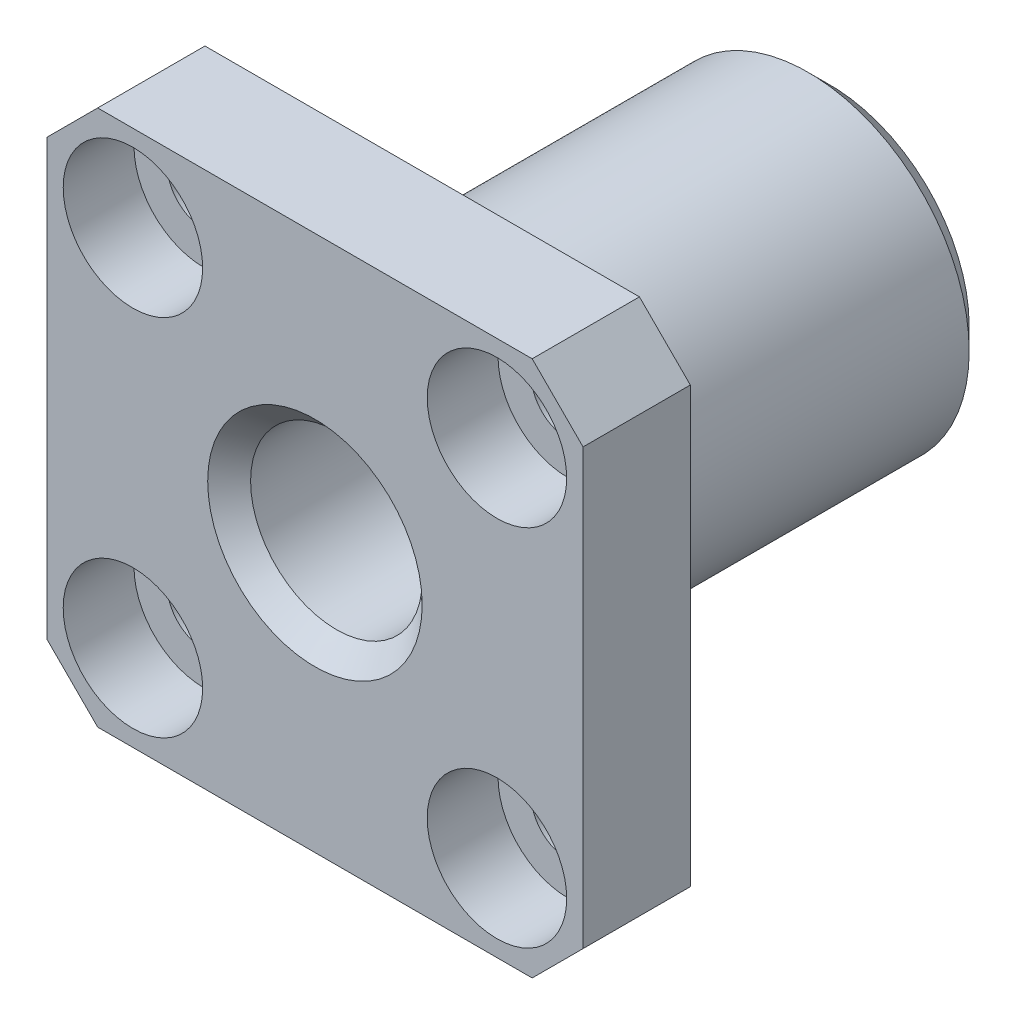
ISO-10303-21;
HEADER;
FILE_DESCRIPTION(('STEP AP214'),'2;1');
FILE_NAME('part.step','',(''),(''),'','','');
FILE_SCHEMA(('AUTOMOTIVE_DESIGN { 1 0 10303 214 1 1 1 1 }'));
ENDSEC;
DATA;
#1=APPLICATION_CONTEXT('core data for automotive mechanical design processes');
#2=APPLICATION_PROTOCOL_DEFINITION('international standard','automotive_design',2000,#1);
#3=PRODUCT_CONTEXT('',#1,'mechanical');
#4=PRODUCT('Part','Part','',(#3));
#5=PRODUCT_RELATED_PRODUCT_CATEGORY('part','',(#4));
#6=PRODUCT_DEFINITION_FORMATION('','',#4);
#7=PRODUCT_DEFINITION_CONTEXT('part definition',#1,'design');
#8=PRODUCT_DEFINITION('design','',#6,#7);
#9=PRODUCT_DEFINITION_SHAPE('','',#8);
#10=(LENGTH_UNIT() NAMED_UNIT(*) SI_UNIT(.MILLI.,.METRE.));
#11=(NAMED_UNIT(*) PLANE_ANGLE_UNIT() SI_UNIT($,.RADIAN.));
#12=(NAMED_UNIT(*) SI_UNIT($,.STERADIAN.) SOLID_ANGLE_UNIT());
#13=UNCERTAINTY_MEASURE_WITH_UNIT(LENGTH_MEASURE(1.E-05),#10,'distance_accuracy_value','');
#14=(GEOMETRIC_REPRESENTATION_CONTEXT(3) GLOBAL_UNCERTAINTY_ASSIGNED_CONTEXT((#13)) GLOBAL_UNIT_ASSIGNED_CONTEXT((#10,
#11,#12)) REPRESENTATION_CONTEXT('',''));
#15=CARTESIAN_POINT('',(0.,0.,0.));
#16=DIRECTION('',(0.,0.,1.));
#17=DIRECTION('',(1.,0.,0.));
#18=AXIS2_PLACEMENT_3D('',#15,#16,#17);
#19=CARTESIAN_POINT('',(0.,0.,23.));
#20=DIRECTION('',(0.,0.,1.));
#21=DIRECTION('',(1.,0.,0.));
#22=AXIS2_PLACEMENT_3D('',#19,#20,#21);
#23=CONICAL_SURFACE('',#22,4.,0.785398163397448);
#24=CARTESIAN_POINT('',(0.,0.,23.));
#25=DIRECTION('',(0.,0.,1.));
#26=DIRECTION('',(1.,0.,0.));
#27=AXIS2_PLACEMENT_3D('',#24,#25,#26);
#28=CIRCLE('',#27,4.);
#29=CARTESIAN_POINT('',(4.,0.,23.));
#30=VERTEX_POINT('',#29);
#31=CARTESIAN_POINT('',(-4.,0.,23.));
#32=VERTEX_POINT('',#31);
#33=EDGE_CURVE('E18',#30,#32,#28,.T.);
#34=ORIENTED_EDGE('',*,*,#33,.F.);
#35=CARTESIAN_POINT('',(0.,0.,23.));
#36=DIRECTION('',(0.,0.,1.));
#37=DIRECTION('',(1.,0.,0.));
#38=AXIS2_PLACEMENT_3D('',#35,#36,#37);
#39=CIRCLE('',#38,4.);
#40=EDGE_CURVE('E530',#32,#30,#39,.T.);
#41=ORIENTED_EDGE('',*,*,#40,.F.);
#42=DIRECTION('',(-0.707106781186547,0.,0.707106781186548));
#43=VECTOR('',#42,1.);
#44=CARTESIAN_POINT('',(-4.,0.,23.));
#45=LINE('',#44,#43);
#46=CARTESIAN_POINT('',(-5.,0.,24.));
#47=VERTEX_POINT('',#46);
#48=EDGE_CURVE('E9',#32,#47,#45,.T.);
#49=ORIENTED_EDGE('',*,*,#48,.T.);
#50=CARTESIAN_POINT('',(0.,0.,24.));
#51=DIRECTION('',(0.,0.,-1.));
#52=DIRECTION('',(1.,0.,0.));
#53=AXIS2_PLACEMENT_3D('',#50,#51,#52);
#54=CIRCLE('',#53,5.);
#55=CARTESIAN_POINT('',(5.,0.,24.));
#56=VERTEX_POINT('',#55);
#57=EDGE_CURVE('E453',#56,#47,#54,.T.);
#58=ORIENTED_EDGE('',*,*,#57,.F.);
#59=CARTESIAN_POINT('',(0.,0.,24.));
#60=DIRECTION('',(0.,0.,-1.));
#61=DIRECTION('',(1.,0.,0.));
#62=AXIS2_PLACEMENT_3D('',#59,#60,#61);
#63=CIRCLE('',#62,5.);
#64=EDGE_CURVE('E457',#47,#56,#63,.T.);
#65=ORIENTED_EDGE('',*,*,#64,.F.);
#66=ORIENTED_EDGE('',*,*,#48,.F.);
#67=EDGE_LOOP('',(#34,#41,#49,#58,#65,#66));
#68=FACE_BOUND('',#67,.T.);
#69=ADVANCED_FACE('F15',(#68),#23,.F.);
#70=CARTESIAN_POINT('',(0.,0.,1.));
#71=DIRECTION('',(0.,0.,1.));
#72=DIRECTION('',(1.,0.,0.));
#73=AXIS2_PLACEMENT_3D('',#70,#71,#72);
#74=CONICAL_SURFACE('',#73,7.5,0.785398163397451);
#75=CARTESIAN_POINT('',(0.,0.,1.));
#76=DIRECTION('',(0.,0.,1.));
#77=DIRECTION('',(1.,0.,0.));
#78=AXIS2_PLACEMENT_3D('',#75,#76,#77);
#79=CIRCLE('',#78,7.5);
#80=CARTESIAN_POINT('',(-7.5,0.,1.));
#81=VERTEX_POINT('',#80);
#82=CARTESIAN_POINT('',(7.5,0.,1.));
#83=VERTEX_POINT('',#82);
#84=EDGE_CURVE('E273',#81,#83,#79,.T.);
#85=ORIENTED_EDGE('',*,*,#84,.F.);
#86=DIRECTION('',(0.707106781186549,0.,-0.707106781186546));
#87=VECTOR('',#86,1.);
#88=CARTESIAN_POINT('',(-7.5,0.,1.));
#89=LINE('',#88,#87);
#90=CARTESIAN_POINT('',(-6.5,0.,0.));
#91=VERTEX_POINT('',#90);
#92=EDGE_CURVE('E24',#81,#91,#89,.T.);
#93=ORIENTED_EDGE('',*,*,#92,.T.);
#94=CARTESIAN_POINT('',(0.,0.,0.));
#95=DIRECTION('',(0.,0.,-1.));
#96=DIRECTION('',(1.,0.,0.));
#97=AXIS2_PLACEMENT_3D('',#94,#95,#96);
#98=CIRCLE('',#97,6.5);
#99=CARTESIAN_POINT('',(6.5,0.,0.));
#100=VERTEX_POINT('',#99);
#101=EDGE_CURVE('E276',#100,#91,#98,.T.);
#102=ORIENTED_EDGE('',*,*,#101,.F.);
#103=CARTESIAN_POINT('',(0.,0.,0.));
#104=DIRECTION('',(0.,0.,-1.));
#105=DIRECTION('',(1.,0.,0.));
#106=AXIS2_PLACEMENT_3D('',#103,#104,#105);
#107=CIRCLE('',#106,6.5);
#108=EDGE_CURVE('E265',#91,#100,#107,.T.);
#109=ORIENTED_EDGE('',*,*,#108,.F.);
#110=ORIENTED_EDGE('',*,*,#92,.F.);
#111=CARTESIAN_POINT('',(0.,0.,1.));
#112=DIRECTION('',(0.,0.,1.));
#113=DIRECTION('',(1.,0.,0.));
#114=AXIS2_PLACEMENT_3D('',#111,#112,#113);
#115=CIRCLE('',#114,7.5);
#116=EDGE_CURVE('E262',#83,#81,#115,.T.);
#117=ORIENTED_EDGE('',*,*,#116,.F.);
#118=EDGE_LOOP('',(#85,#93,#102,#109,#110,#117));
#119=FACE_BOUND('',#118,.T.);
#120=ADVANCED_FACE('F261',(#119),#74,.T.);
#121=CARTESIAN_POINT('',(0.,0.,0.));
#122=DIRECTION('',(0.,0.,1.));
#123=DIRECTION('',(1.,0.,0.));
#124=AXIS2_PLACEMENT_3D('',#121,#122,#123);
#125=CYLINDRICAL_SURFACE('',#124,4.);
#126=CARTESIAN_POINT('',(0.,0.,0.));
#127=DIRECTION('',(0.,0.,1.));
#128=DIRECTION('',(1.,0.,0.));
#129=AXIS2_PLACEMENT_3D('',#126,#127,#128);
#130=CIRCLE('',#129,4.);
#131=CARTESIAN_POINT('',(4.,0.,0.));
#132=VERTEX_POINT('',#131);
#133=CARTESIAN_POINT('',(-4.,0.,0.));
#134=VERTEX_POINT('',#133);
#135=EDGE_CURVE('E337',#132,#134,#130,.T.);
#136=ORIENTED_EDGE('',*,*,#135,.F.);
#137=CARTESIAN_POINT('',(0.,0.,0.));
#138=DIRECTION('',(0.,0.,1.));
#139=DIRECTION('',(1.,0.,0.));
#140=AXIS2_PLACEMENT_3D('',#137,#138,#139);
#141=CIRCLE('',#140,4.);
#142=EDGE_CURVE('E341',#134,#132,#141,.T.);
#143=ORIENTED_EDGE('',*,*,#142,.F.);
#144=DIRECTION('',(0.,0.,1.));
#145=VECTOR('',#144,1.);
#146=CARTESIAN_POINT('',(-4.,0.,0.));
#147=LINE('',#146,#145);
#148=EDGE_CURVE('E527',#134,#32,#147,.T.);
#149=ORIENTED_EDGE('',*,*,#148,.T.);
#150=ORIENTED_EDGE('',*,*,#40,.T.);
#151=ORIENTED_EDGE('',*,*,#33,.T.);
#152=ORIENTED_EDGE('',*,*,#148,.F.);
#153=EDGE_LOOP('',(#136,#143,#149,#150,#151,#152));
#154=FACE_BOUND('',#153,.T.);
#155=ADVANCED_FACE('F539',(#154),#125,.F.);
#156=CARTESIAN_POINT('',(-8.48528137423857,8.48528137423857,24.));
#157=DIRECTION('',(0.,0.,1.));
#158=DIRECTION('',(1.,0.,0.));
#159=AXIS2_PLACEMENT_3D('',#156,#157,#158);
#160=CYLINDRICAL_SURFACE('',#159,3.25);
#161=CARTESIAN_POINT('',(-8.48528137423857,8.48528137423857,20.7));
#162=DIRECTION('',(0.,0.,1.));
#163=DIRECTION('',(1.,0.,0.));
#164=AXIS2_PLACEMENT_3D('',#161,#162,#163);
#165=CIRCLE('',#164,3.25);
#166=CARTESIAN_POINT('',(-5.23528137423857,8.48528137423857,20.7));
#167=VERTEX_POINT('',#166);
#168=CARTESIAN_POINT('',(-11.7352813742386,8.48528137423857,20.7));
#169=VERTEX_POINT('',#168);
#170=EDGE_CURVE('E517',#167,#169,#165,.T.);
#171=ORIENTED_EDGE('',*,*,#170,.F.);
#172=CARTESIAN_POINT('',(-8.48528137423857,8.48528137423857,20.7));
#173=DIRECTION('',(0.,0.,1.));
#174=DIRECTION('',(1.,0.,0.));
#175=AXIS2_PLACEMENT_3D('',#172,#173,#174);
#176=CIRCLE('',#175,3.25);
#177=EDGE_CURVE('E521',#169,#167,#176,.T.);
#178=ORIENTED_EDGE('',*,*,#177,.F.);
#179=DIRECTION('',(0.,0.,1.));
#180=VECTOR('',#179,1.);
#181=CARTESIAN_POINT('',(-11.7352813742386,8.48528137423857,24.));
#182=LINE('',#181,#180);
#183=CARTESIAN_POINT('',(-11.7352813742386,8.48528137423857,24.));
#184=VERTEX_POINT('',#183);
#185=EDGE_CURVE('E524',#169,#184,#182,.T.);
#186=ORIENTED_EDGE('',*,*,#185,.T.);
#187=CARTESIAN_POINT('',(-8.48528137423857,8.48528137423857,24.));
#188=DIRECTION('',(0.,0.,1.));
#189=DIRECTION('',(1.,0.,0.));
#190=AXIS2_PLACEMENT_3D('',#187,#188,#189);
#191=CIRCLE('',#190,3.25);
#192=CARTESIAN_POINT('',(-5.23528137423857,8.48528137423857,24.));
#193=VERTEX_POINT('',#192);
#194=EDGE_CURVE('E464',#184,#193,#191,.T.);
#195=ORIENTED_EDGE('',*,*,#194,.T.);
#196=CARTESIAN_POINT('',(-8.48528137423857,8.48528137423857,24.));
#197=DIRECTION('',(0.,0.,1.));
#198=DIRECTION('',(1.,0.,0.));
#199=AXIS2_PLACEMENT_3D('',#196,#197,#198);
#200=CIRCLE('',#199,3.25);
#201=EDGE_CURVE('E460',#193,#184,#200,.T.);
#202=ORIENTED_EDGE('',*,*,#201,.T.);
#203=ORIENTED_EDGE('',*,*,#185,.F.);
#204=EDGE_LOOP('',(#171,#178,#186,#195,#202,#203));
#205=FACE_BOUND('',#204,.T.);
#206=ADVANCED_FACE('F565',(#205),#160,.F.);
#207=CARTESIAN_POINT('',(-6.78528137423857,8.48528137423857,20.7));
#208=DIRECTION('',(0.,0.,-1.));
#209=DIRECTION('',(0.,-1.,0.));
#210=AXIS2_PLACEMENT_3D('',#207,#208,#209);
#211=PLANE('',#210);
#212=CARTESIAN_POINT('',(-8.48528137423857,8.48528137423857,20.7));
#213=DIRECTION('',(0.,0.,1.));
#214=DIRECTION('',(1.,0.,0.));
#215=AXIS2_PLACEMENT_3D('',#212,#213,#214);
#216=CIRCLE('',#215,1.7);
#217=CARTESIAN_POINT('',(-6.78528137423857,8.48528137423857,20.7));
#218=VERTEX_POINT('',#217);
#219=CARTESIAN_POINT('',(-10.1852813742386,8.48528137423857,20.7));
#220=VERTEX_POINT('',#219);
#221=EDGE_CURVE('E416',#218,#220,#216,.T.);
#222=ORIENTED_EDGE('',*,*,#221,.F.);
#223=CARTESIAN_POINT('',(-8.48528137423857,8.48528137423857,20.7));
#224=DIRECTION('',(0.,0.,1.));
#225=DIRECTION('',(1.,0.,0.));
#226=AXIS2_PLACEMENT_3D('',#223,#224,#225);
#227=CIRCLE('',#226,1.7);
#228=EDGE_CURVE('E412',#220,#218,#227,.T.);
#229=ORIENTED_EDGE('',*,*,#228,.F.);
#230=EDGE_LOOP('',(#222,#229));
#231=FACE_BOUND('',#230,.T.);
#232=ORIENTED_EDGE('',*,*,#170,.T.);
#233=ORIENTED_EDGE('',*,*,#177,.T.);
#234=EDGE_LOOP('',(#232,#233));
#235=FACE_BOUND('',#234,.T.);
#236=ADVANCED_FACE('F568',(#231,#235),#211,.F.);
#237=CARTESIAN_POINT('',(-8.48528137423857,8.48528137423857,24.));
#238=DIRECTION('',(0.,0.,1.));
#239=DIRECTION('',(1.,0.,0.));
#240=AXIS2_PLACEMENT_3D('',#237,#238,#239);
#241=CYLINDRICAL_SURFACE('',#240,1.7);
#242=CARTESIAN_POINT('',(-8.48528137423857,8.48528137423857,19.));
#243=DIRECTION('',(0.,0.,-1.));
#244=DIRECTION('',(-1.,0.,0.));
#245=AXIS2_PLACEMENT_3D('',#242,#243,#244);
#246=CIRCLE('',#245,1.7);
#247=CARTESIAN_POINT('',(-10.1852813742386,8.48528137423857,19.));
#248=VERTEX_POINT('',#247);
#249=EDGE_CURVE('E370',#248,#248,#246,.T.);
#250=ORIENTED_EDGE('',*,*,#249,.T.);
#251=DIRECTION('',(0.,0.,1.));
#252=VECTOR('',#251,1.);
#253=CARTESIAN_POINT('',(-10.1852813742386,8.48528137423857,24.));
#254=LINE('',#253,#252);
#255=EDGE_CURVE('E297',#248,#220,#254,.T.);
#256=ORIENTED_EDGE('',*,*,#255,.T.);
#257=ORIENTED_EDGE('',*,*,#228,.T.);
#258=ORIENTED_EDGE('',*,*,#221,.T.);
#259=ORIENTED_EDGE('',*,*,#255,.F.);
#260=EDGE_LOOP('',(#250,#256,#257,#258,#259));
#261=FACE_BOUND('',#260,.T.);
#262=ADVANCED_FACE('F571',(#261),#241,.F.);
#263=CARTESIAN_POINT('',(8.48528137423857,8.48528137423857,24.));
#264=DIRECTION('',(0.,0.,1.));
#265=DIRECTION('',(1.,0.,0.));
#266=AXIS2_PLACEMENT_3D('',#263,#264,#265);
#267=CYLINDRICAL_SURFACE('',#266,3.25);
#268=CARTESIAN_POINT('',(8.48528137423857,8.48528137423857,20.7));
#269=DIRECTION('',(0.,0.,1.));
#270=DIRECTION('',(1.,0.,0.));
#271=AXIS2_PLACEMENT_3D('',#268,#269,#270);
#272=CIRCLE('',#271,3.25);
#273=CARTESIAN_POINT('',(11.7352813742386,8.48528137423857,20.7));
#274=VERTEX_POINT('',#273);
#275=CARTESIAN_POINT('',(5.23528137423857,8.48528137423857,20.7));
#276=VERTEX_POINT('',#275);
#277=EDGE_CURVE('E364',#274,#276,#272,.T.);
#278=ORIENTED_EDGE('',*,*,#277,.F.);
#279=CARTESIAN_POINT('',(8.48528137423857,8.48528137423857,20.7));
#280=DIRECTION('',(0.,0.,1.));
#281=DIRECTION('',(1.,0.,0.));
#282=AXIS2_PLACEMENT_3D('',#279,#280,#281);
#283=CIRCLE('',#282,3.25);
#284=EDGE_CURVE('E298',#276,#274,#283,.T.);
#285=ORIENTED_EDGE('',*,*,#284,.F.);
#286=DIRECTION('',(0.,0.,1.));
#287=VECTOR('',#286,1.);
#288=CARTESIAN_POINT('',(5.23528137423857,8.48528137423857,24.));
#289=LINE('',#288,#287);
#290=CARTESIAN_POINT('',(5.23528137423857,8.48528137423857,24.));
#291=VERTEX_POINT('',#290);
#292=EDGE_CURVE('E294',#276,#291,#289,.T.);
#293=ORIENTED_EDGE('',*,*,#292,.T.);
#294=CARTESIAN_POINT('',(8.48528137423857,8.48528137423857,24.));
#295=DIRECTION('',(0.,0.,1.));
#296=DIRECTION('',(1.,0.,0.));
#297=AXIS2_PLACEMENT_3D('',#294,#295,#296);
#298=CIRCLE('',#297,3.25);
#299=CARTESIAN_POINT('',(11.7352813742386,8.48528137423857,24.));
#300=VERTEX_POINT('',#299);
#301=EDGE_CURVE('E471',#291,#300,#298,.T.);
#302=ORIENTED_EDGE('',*,*,#301,.T.);
#303=CARTESIAN_POINT('',(8.48528137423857,8.48528137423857,24.));
#304=DIRECTION('',(0.,0.,1.));
#305=DIRECTION('',(1.,0.,0.));
#306=AXIS2_PLACEMENT_3D('',#303,#304,#305);
#307=CIRCLE('',#306,3.25);
#308=EDGE_CURVE('E467',#300,#291,#307,.T.);
#309=ORIENTED_EDGE('',*,*,#308,.T.);
#310=ORIENTED_EDGE('',*,*,#292,.F.);
#311=EDGE_LOOP('',(#278,#285,#293,#302,#309,#310));
#312=FACE_BOUND('',#311,.T.);
#313=ADVANCED_FACE('F575',(#312),#267,.F.);
#314=CARTESIAN_POINT('',(10.1852813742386,8.48528137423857,20.7));
#315=DIRECTION('',(0.,0.,-1.));
#316=DIRECTION('',(0.,-1.,0.));
#317=AXIS2_PLACEMENT_3D('',#314,#315,#316);
#318=PLANE('',#317);
#319=CARTESIAN_POINT('',(8.48528137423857,8.48528137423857,20.7));
#320=DIRECTION('',(0.,0.,1.));
#321=DIRECTION('',(1.,0.,0.));
#322=AXIS2_PLACEMENT_3D('',#319,#320,#321);
#323=CIRCLE('',#322,1.7);
#324=CARTESIAN_POINT('',(10.1852813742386,8.48528137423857,20.7));
#325=VERTEX_POINT('',#324);
#326=CARTESIAN_POINT('',(6.78528137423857,8.48528137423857,20.7));
#327=VERTEX_POINT('',#326);
#328=EDGE_CURVE('E333',#325,#327,#323,.T.);
#329=ORIENTED_EDGE('',*,*,#328,.F.);
#330=CARTESIAN_POINT('',(8.48528137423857,8.48528137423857,20.7));
#331=DIRECTION('',(0.,0.,1.));
#332=DIRECTION('',(1.,0.,0.));
#333=AXIS2_PLACEMENT_3D('',#330,#331,#332);
#334=CIRCLE('',#333,1.7);
#335=EDGE_CURVE('E329',#327,#325,#334,.T.);
#336=ORIENTED_EDGE('',*,*,#335,.F.);
#337=EDGE_LOOP('',(#329,#336));
#338=FACE_BOUND('',#337,.T.);
#339=ORIENTED_EDGE('',*,*,#277,.T.);
#340=ORIENTED_EDGE('',*,*,#284,.T.);
#341=EDGE_LOOP('',(#339,#340));
#342=FACE_BOUND('',#341,.T.);
#343=ADVANCED_FACE('F577',(#338,#342),#318,.F.);
#344=CARTESIAN_POINT('',(8.48528137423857,8.48528137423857,24.));
#345=DIRECTION('',(0.,0.,1.));
#346=DIRECTION('',(1.,0.,0.));
#347=AXIS2_PLACEMENT_3D('',#344,#345,#346);
#348=CYLINDRICAL_SURFACE('',#347,1.7);
#349=CARTESIAN_POINT('',(8.48528137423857,8.48528137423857,19.));
#350=DIRECTION('',(0.,0.,-1.));
#351=DIRECTION('',(-1.,0.,0.));
#352=AXIS2_PLACEMENT_3D('',#349,#350,#351);
#353=CIRCLE('',#352,1.7);
#354=CARTESIAN_POINT('',(6.78528137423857,8.48528137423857,19.));
#355=VERTEX_POINT('',#354);
#356=EDGE_CURVE('E365',#355,#355,#353,.T.);
#357=ORIENTED_EDGE('',*,*,#356,.T.);
#358=DIRECTION('',(0.,0.,1.));
#359=VECTOR('',#358,1.);
#360=CARTESIAN_POINT('',(6.78528137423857,8.48528137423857,24.));
#361=LINE('',#360,#359);
#362=EDGE_CURVE('E334',#355,#327,#361,.T.);
#363=ORIENTED_EDGE('',*,*,#362,.T.);
#364=ORIENTED_EDGE('',*,*,#335,.T.);
#365=ORIENTED_EDGE('',*,*,#328,.T.);
#366=ORIENTED_EDGE('',*,*,#362,.F.);
#367=EDGE_LOOP('',(#357,#363,#364,#365,#366));
#368=FACE_BOUND('',#367,.T.);
#369=ADVANCED_FACE('F580',(#368),#348,.F.);
#370=CARTESIAN_POINT('',(8.48528137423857,-8.48528137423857,24.));
#371=DIRECTION('',(0.,0.,1.));
#372=DIRECTION('',(1.,0.,0.));
#373=AXIS2_PLACEMENT_3D('',#370,#371,#372);
#374=CYLINDRICAL_SURFACE('',#373,3.25);
#375=CARTESIAN_POINT('',(8.48528137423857,-8.48528137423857,20.7));
#376=DIRECTION('',(0.,0.,1.));
#377=DIRECTION('',(1.,0.,0.));
#378=AXIS2_PLACEMENT_3D('',#375,#376,#377);
#379=CIRCLE('',#378,3.25);
#380=CARTESIAN_POINT('',(11.7352813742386,-8.48528137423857,20.7));
#381=VERTEX_POINT('',#380);
#382=CARTESIAN_POINT('',(5.23528137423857,-8.48528137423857,20.7));
#383=VERTEX_POINT('',#382);
#384=EDGE_CURVE('E342',#381,#383,#379,.T.);
#385=ORIENTED_EDGE('',*,*,#384,.F.);
#386=CARTESIAN_POINT('',(8.48528137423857,-8.48528137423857,20.7));
#387=DIRECTION('',(0.,0.,1.));
#388=DIRECTION('',(1.,0.,0.));
#389=AXIS2_PLACEMENT_3D('',#386,#387,#388);
#390=CIRCLE('',#389,3.25);
#391=EDGE_CURVE('E346',#383,#381,#390,.T.);
#392=ORIENTED_EDGE('',*,*,#391,.F.);
#393=DIRECTION('',(0.,0.,1.));
#394=VECTOR('',#393,1.);
#395=CARTESIAN_POINT('',(5.23528137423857,-8.48528137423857,24.));
#396=LINE('',#395,#394);
#397=CARTESIAN_POINT('',(5.23528137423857,-8.48528137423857,24.));
#398=VERTEX_POINT('',#397);
#399=EDGE_CURVE('E504',#383,#398,#396,.T.);
#400=ORIENTED_EDGE('',*,*,#399,.T.);
#401=CARTESIAN_POINT('',(8.48528137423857,-8.48528137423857,24.));
#402=DIRECTION('',(0.,0.,1.));
#403=DIRECTION('',(1.,0.,0.));
#404=AXIS2_PLACEMENT_3D('',#401,#402,#403);
#405=CIRCLE('',#404,3.25);
#406=CARTESIAN_POINT('',(11.7352813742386,-8.48528137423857,24.));
#407=VERTEX_POINT('',#406);
#408=EDGE_CURVE('E319',#398,#407,#405,.T.);
#409=ORIENTED_EDGE('',*,*,#408,.T.);
#410=CARTESIAN_POINT('',(8.48528137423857,-8.48528137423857,24.));
#411=DIRECTION('',(0.,0.,1.));
#412=DIRECTION('',(1.,0.,0.));
#413=AXIS2_PLACEMENT_3D('',#410,#411,#412);
#414=CIRCLE('',#413,3.25);
#415=EDGE_CURVE('E474',#407,#398,#414,.T.);
#416=ORIENTED_EDGE('',*,*,#415,.T.);
#417=ORIENTED_EDGE('',*,*,#399,.F.);
#418=EDGE_LOOP('',(#385,#392,#400,#409,#416,#417));
#419=FACE_BOUND('',#418,.T.);
#420=ADVANCED_FACE('F584',(#419),#374,.F.);
#421=CARTESIAN_POINT('',(10.1852813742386,-8.48528137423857,20.7));
#422=DIRECTION('',(0.,0.,-1.));
#423=DIRECTION('',(0.,-1.,0.));
#424=AXIS2_PLACEMENT_3D('',#421,#422,#423);
#425=PLANE('',#424);
#426=CARTESIAN_POINT('',(8.48528137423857,-8.48528137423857,20.7));
#427=DIRECTION('',(0.,0.,1.));
#428=DIRECTION('',(1.,0.,0.));
#429=AXIS2_PLACEMENT_3D('',#426,#427,#428);
#430=CIRCLE('',#429,1.7);
#431=CARTESIAN_POINT('',(10.1852813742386,-8.48528137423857,20.7));
#432=VERTEX_POINT('',#431);
#433=CARTESIAN_POINT('',(6.78528137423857,-8.48528137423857,20.7));
#434=VERTEX_POINT('',#433);
#435=EDGE_CURVE('E347',#432,#434,#430,.T.);
#436=ORIENTED_EDGE('',*,*,#435,.F.);
#437=CARTESIAN_POINT('',(8.48528137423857,-8.48528137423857,20.7));
#438=DIRECTION('',(0.,0.,1.));
#439=DIRECTION('',(1.,0.,0.));
#440=AXIS2_PLACEMENT_3D('',#437,#438,#439);
#441=CIRCLE('',#440,1.7);
#442=EDGE_CURVE('E417',#434,#432,#441,.T.);
#443=ORIENTED_EDGE('',*,*,#442,.F.);
#444=EDGE_LOOP('',(#436,#443));
#445=FACE_BOUND('',#444,.T.);
#446=ORIENTED_EDGE('',*,*,#384,.T.);
#447=ORIENTED_EDGE('',*,*,#391,.T.);
#448=EDGE_LOOP('',(#446,#447));
#449=FACE_BOUND('',#448,.T.);
#450=ADVANCED_FACE('F588',(#445,#449),#425,.F.);
#451=CARTESIAN_POINT('',(8.48528137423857,-8.48528137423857,24.));
#452=DIRECTION('',(0.,0.,1.));
#453=DIRECTION('',(1.,0.,0.));
#454=AXIS2_PLACEMENT_3D('',#451,#452,#453);
#455=CYLINDRICAL_SURFACE('',#454,1.7);
#456=CARTESIAN_POINT('',(8.48528137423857,-8.48528137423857,19.));
#457=DIRECTION('',(0.,0.,-1.));
#458=DIRECTION('',(-1.,0.,0.));
#459=AXIS2_PLACEMENT_3D('',#456,#457,#458);
#460=CIRCLE('',#459,1.7);
#461=CARTESIAN_POINT('',(6.78528137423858,-8.48528137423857,19.));
#462=VERTEX_POINT('',#461);
#463=EDGE_CURVE('E369',#462,#462,#460,.T.);
#464=ORIENTED_EDGE('',*,*,#463,.T.);
#465=DIRECTION('',(0.,0.,1.));
#466=VECTOR('',#465,1.);
#467=CARTESIAN_POINT('',(6.78528137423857,-8.48528137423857,24.));
#468=LINE('',#467,#466);
#469=EDGE_CURVE('E421',#462,#434,#468,.T.);
#470=ORIENTED_EDGE('',*,*,#469,.T.);
#471=ORIENTED_EDGE('',*,*,#442,.T.);
#472=ORIENTED_EDGE('',*,*,#435,.T.);
#473=ORIENTED_EDGE('',*,*,#469,.F.);
#474=EDGE_LOOP('',(#464,#470,#471,#472,#473));
#475=FACE_BOUND('',#474,.T.);
#476=ADVANCED_FACE('F594',(#475),#455,.F.);
#477=CARTESIAN_POINT('',(-8.48528137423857,-8.48528137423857,24.));
#478=DIRECTION('',(0.,0.,1.));
#479=DIRECTION('',(1.,0.,0.));
#480=AXIS2_PLACEMENT_3D('',#477,#478,#479);
#481=CYLINDRICAL_SURFACE('',#480,3.25);
#482=CARTESIAN_POINT('',(-8.48528137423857,-8.48528137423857,20.7));
#483=DIRECTION('',(0.,0.,1.));
#484=DIRECTION('',(1.,0.,0.));
#485=AXIS2_PLACEMENT_3D('',#482,#483,#484);
#486=CIRCLE('',#485,3.25);
#487=CARTESIAN_POINT('',(-5.23528137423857,-8.48528137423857,20.7));
#488=VERTEX_POINT('',#487);
#489=CARTESIAN_POINT('',(-11.7352813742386,-8.48528137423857,20.7));
#490=VERTEX_POINT('',#489);
#491=EDGE_CURVE('E312',#488,#490,#486,.T.);
#492=ORIENTED_EDGE('',*,*,#491,.F.);
#493=CARTESIAN_POINT('',(-8.48528137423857,-8.48528137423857,20.7));
#494=DIRECTION('',(0.,0.,1.));
#495=DIRECTION('',(1.,0.,0.));
#496=AXIS2_PLACEMENT_3D('',#493,#494,#495);
#497=CIRCLE('',#496,3.25);
#498=EDGE_CURVE('E308',#490,#488,#497,.T.);
#499=ORIENTED_EDGE('',*,*,#498,.F.);
#500=DIRECTION('',(0.,0.,1.));
#501=VECTOR('',#500,1.);
#502=CARTESIAN_POINT('',(-11.7352813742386,-8.48528137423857,24.));
#503=LINE('',#502,#501);
#504=CARTESIAN_POINT('',(-11.7352813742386,-8.48528137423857,24.));
#505=VERTEX_POINT('',#504);
#506=EDGE_CURVE('E311',#490,#505,#503,.T.);
#507=ORIENTED_EDGE('',*,*,#506,.T.);
#508=CARTESIAN_POINT('',(-8.48528137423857,-8.48528137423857,24.));
#509=DIRECTION('',(0.,0.,1.));
#510=DIRECTION('',(1.,0.,0.));
#511=AXIS2_PLACEMENT_3D('',#508,#509,#510);
#512=CIRCLE('',#511,3.25);
#513=CARTESIAN_POINT('',(-5.23528137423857,-8.48528137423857,24.));
#514=VERTEX_POINT('',#513);
#515=EDGE_CURVE('E318',#505,#514,#512,.T.);
#516=ORIENTED_EDGE('',*,*,#515,.T.);
#517=CARTESIAN_POINT('',(-8.48528137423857,-8.48528137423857,24.));
#518=DIRECTION('',(0.,0.,1.));
#519=DIRECTION('',(1.,0.,0.));
#520=AXIS2_PLACEMENT_3D('',#517,#518,#519);
#521=CIRCLE('',#520,3.25);
#522=EDGE_CURVE('E315',#514,#505,#521,.T.);
#523=ORIENTED_EDGE('',*,*,#522,.T.);
#524=ORIENTED_EDGE('',*,*,#506,.F.);
#525=EDGE_LOOP('',(#492,#499,#507,#516,#523,#524));
#526=FACE_BOUND('',#525,.T.);
#527=ADVANCED_FACE('F590',(#526),#481,.F.);
#528=CARTESIAN_POINT('',(-6.78528137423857,-8.48528137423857,20.7));
#529=DIRECTION('',(0.,0.,-1.));
#530=DIRECTION('',(0.,-1.,0.));
#531=AXIS2_PLACEMENT_3D('',#528,#529,#530);
#532=PLANE('',#531);
#533=CARTESIAN_POINT('',(-8.48528137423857,-8.48528137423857,20.7));
#534=DIRECTION('',(0.,0.,1.));
#535=DIRECTION('',(1.,0.,0.));
#536=AXIS2_PLACEMENT_3D('',#533,#534,#535);
#537=CIRCLE('',#536,1.7);
#538=CARTESIAN_POINT('',(-6.78528137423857,-8.48528137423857,20.7));
#539=VERTEX_POINT('',#538);
#540=CARTESIAN_POINT('',(-10.1852813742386,-8.48528137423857,20.7));
#541=VERTEX_POINT('',#540);
#542=EDGE_CURVE('E430',#539,#541,#537,.T.);
#543=ORIENTED_EDGE('',*,*,#542,.F.);
#544=CARTESIAN_POINT('',(-8.48528137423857,-8.48528137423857,20.7));
#545=DIRECTION('',(0.,0.,1.));
#546=DIRECTION('',(1.,0.,0.));
#547=AXIS2_PLACEMENT_3D('',#544,#545,#546);
#548=CIRCLE('',#547,1.7);
#549=EDGE_CURVE('E433',#541,#539,#548,.T.);
#550=ORIENTED_EDGE('',*,*,#549,.F.);
#551=EDGE_LOOP('',(#543,#550));
#552=FACE_BOUND('',#551,.T.);
#553=ORIENTED_EDGE('',*,*,#491,.T.);
#554=ORIENTED_EDGE('',*,*,#498,.T.);
#555=EDGE_LOOP('',(#553,#554));
#556=FACE_BOUND('',#555,.T.);
#557=ADVANCED_FACE('F593',(#552,#556),#532,.F.);
#558=CARTESIAN_POINT('',(-8.48528137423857,-8.48528137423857,24.));
#559=DIRECTION('',(0.,0.,1.));
#560=DIRECTION('',(1.,0.,0.));
#561=AXIS2_PLACEMENT_3D('',#558,#559,#560);
#562=CYLINDRICAL_SURFACE('',#561,1.7);
#563=CARTESIAN_POINT('',(-8.48528137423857,-8.48528137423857,19.));
#564=DIRECTION('',(0.,0.,-1.));
#565=DIRECTION('',(-1.,0.,0.));
#566=AXIS2_PLACEMENT_3D('',#563,#564,#565);
#567=CIRCLE('',#566,1.7);
#568=CARTESIAN_POINT('',(-10.1852813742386,-8.48528137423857,19.));
#569=VERTEX_POINT('',#568);
#570=EDGE_CURVE('E437',#569,#569,#567,.T.);
#571=ORIENTED_EDGE('',*,*,#570,.T.);
#572=DIRECTION('',(0.,0.,1.));
#573=VECTOR('',#572,1.);
#574=CARTESIAN_POINT('',(-10.1852813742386,-8.48528137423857,24.));
#575=LINE('',#574,#573);
#576=EDGE_CURVE('E482',#569,#541,#575,.T.);
#577=ORIENTED_EDGE('',*,*,#576,.T.);
#578=ORIENTED_EDGE('',*,*,#549,.T.);
#579=ORIENTED_EDGE('',*,*,#542,.T.);
#580=ORIENTED_EDGE('',*,*,#576,.F.);
#581=EDGE_LOOP('',(#571,#577,#578,#579,#580));
#582=FACE_BOUND('',#581,.T.);
#583=ADVANCED_FACE('F600',(#582),#562,.F.);
#584=CARTESIAN_POINT('',(-12.5,-10.1274169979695,0.));
#585=DIRECTION('',(0.707106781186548,0.707106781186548,0.));
#586=DIRECTION('',(0.,0.,-1.));
#587=AXIS2_PLACEMENT_3D('',#584,#585,#586);
#588=PLANE('',#587);
#589=DIRECTION('',(0.707106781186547,-0.707106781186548,0.));
#590=VECTOR('',#589,1.);
#591=CARTESIAN_POINT('',(-12.5,-10.1274169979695,19.));
#592=LINE('',#591,#590);
#593=CARTESIAN_POINT('',(-12.5,-10.1274169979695,19.));
#594=VERTEX_POINT('',#593);
#595=CARTESIAN_POINT('',(-10.1274169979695,-12.5,19.));
#596=VERTEX_POINT('',#595);
#597=EDGE_CURVE('E381',#594,#596,#592,.T.);
#598=ORIENTED_EDGE('',*,*,#597,.T.);
#599=DIRECTION('',(0.,0.,1.));
#600=VECTOR('',#599,1.);
#601=CARTESIAN_POINT('',(-10.1274169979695,-12.5,19.));
#602=LINE('',#601,#600);
#603=CARTESIAN_POINT('',(-10.1274169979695,-12.5,24.));
#604=VERTEX_POINT('',#603);
#605=EDGE_CURVE('E351',#596,#604,#602,.T.);
#606=ORIENTED_EDGE('',*,*,#605,.T.);
#607=DIRECTION('',(-0.707106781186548,0.707106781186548,0.));
#608=VECTOR('',#607,1.);
#609=CARTESIAN_POINT('',(-10.1274169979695,-12.5,24.));
#610=LINE('',#609,#608);
#611=CARTESIAN_POINT('',(-12.5,-10.1274169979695,24.));
#612=VERTEX_POINT('',#611);
#613=EDGE_CURVE('E442',#604,#612,#610,.T.);
#614=ORIENTED_EDGE('',*,*,#613,.T.);
#615=DIRECTION('',(0.,0.,1.));
#616=VECTOR('',#615,1.);
#617=CARTESIAN_POINT('',(-12.5,-10.1274169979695,19.));
#618=LINE('',#617,#616);
#619=EDGE_CURVE('E358',#594,#612,#618,.T.);
#620=ORIENTED_EDGE('',*,*,#619,.F.);
#621=EDGE_LOOP('',(#598,#606,#614,#620));
#622=FACE_BOUND('',#621,.T.);
#623=ADVANCED_FACE('F596',(#622),#588,.F.);
#624=CARTESIAN_POINT('',(12.5,-10.1274169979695,0.));
#625=DIRECTION('',(-0.707106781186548,0.707106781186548,0.));
#626=DIRECTION('',(0.,0.,1.));
#627=AXIS2_PLACEMENT_3D('',#624,#625,#626);
#628=PLANE('',#627);
#629=DIRECTION('',(0.707106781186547,0.707106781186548,0.));
#630=VECTOR('',#629,1.);
#631=CARTESIAN_POINT('',(10.1274169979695,-12.5,19.));
#632=LINE('',#631,#630);
#633=CARTESIAN_POINT('',(10.1274169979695,-12.5,19.));
#634=VERTEX_POINT('',#633);
#635=CARTESIAN_POINT('',(12.5,-10.1274169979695,19.));
#636=VERTEX_POINT('',#635);
#637=EDGE_CURVE('E424',#634,#636,#632,.T.);
#638=ORIENTED_EDGE('',*,*,#637,.T.);
#639=DIRECTION('',(0.,0.,1.));
#640=VECTOR('',#639,1.);
#641=CARTESIAN_POINT('',(12.5,-10.1274169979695,19.));
#642=LINE('',#641,#640);
#643=CARTESIAN_POINT('',(12.5,-10.1274169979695,24.));
#644=VERTEX_POINT('',#643);
#645=EDGE_CURVE('E350',#636,#644,#642,.T.);
#646=ORIENTED_EDGE('',*,*,#645,.T.);
#647=DIRECTION('',(-0.707106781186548,-0.707106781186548,0.));
#648=VECTOR('',#647,1.);
#649=CARTESIAN_POINT('',(12.5,-10.1274169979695,24.));
#650=LINE('',#649,#648);
#651=CARTESIAN_POINT('',(10.1274169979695,-12.5,24.));
#652=VERTEX_POINT('',#651);
#653=EDGE_CURVE('E438',#644,#652,#650,.T.);
#654=ORIENTED_EDGE('',*,*,#653,.T.);
#655=DIRECTION('',(0.,0.,1.));
#656=VECTOR('',#655,1.);
#657=CARTESIAN_POINT('',(10.1274169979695,-12.5,19.));
#658=LINE('',#657,#656);
#659=EDGE_CURVE('E288',#634,#652,#658,.T.);
#660=ORIENTED_EDGE('',*,*,#659,.F.);
#661=EDGE_LOOP('',(#638,#646,#654,#660));
#662=FACE_BOUND('',#661,.T.);
#663=ADVANCED_FACE('F599',(#662),#628,.F.);
#664=CARTESIAN_POINT('',(12.5,10.1274169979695,0.));
#665=DIRECTION('',(-0.707106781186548,-0.707106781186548,0.));
#666=DIRECTION('',(-0.707106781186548,0.707106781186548,0.));
#667=AXIS2_PLACEMENT_3D('',#664,#665,#666);
#668=PLANE('',#667);
#669=DIRECTION('',(-0.707106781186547,0.707106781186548,0.));
#670=VECTOR('',#669,1.);
#671=CARTESIAN_POINT('',(12.5,10.1274169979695,19.));
#672=LINE('',#671,#670);
#673=CARTESIAN_POINT('',(12.5,10.1274169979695,19.));
#674=VERTEX_POINT('',#673);
#675=CARTESIAN_POINT('',(10.1274169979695,12.5,19.));
#676=VERTEX_POINT('',#675);
#677=EDGE_CURVE('E380',#674,#676,#672,.T.);
#678=ORIENTED_EDGE('',*,*,#677,.T.);
#679=DIRECTION('',(0.,0.,1.));
#680=VECTOR('',#679,1.);
#681=CARTESIAN_POINT('',(10.1274169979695,12.5,19.));
#682=LINE('',#681,#680);
#683=CARTESIAN_POINT('',(10.1274169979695,12.5,24.));
#684=VERTEX_POINT('',#683);
#685=EDGE_CURVE('E388',#676,#684,#682,.T.);
#686=ORIENTED_EDGE('',*,*,#685,.T.);
#687=DIRECTION('',(0.707106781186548,-0.707106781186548,0.));
#688=VECTOR('',#687,1.);
#689=CARTESIAN_POINT('',(10.1274169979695,12.5,24.));
#690=LINE('',#689,#688);
#691=CARTESIAN_POINT('',(12.5,10.1274169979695,24.));
#692=VERTEX_POINT('',#691);
#693=EDGE_CURVE('E441',#684,#692,#690,.T.);
#694=ORIENTED_EDGE('',*,*,#693,.T.);
#695=DIRECTION('',(0.,0.,1.));
#696=VECTOR('',#695,1.);
#697=CARTESIAN_POINT('',(12.5,10.1274169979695,19.));
#698=LINE('',#697,#696);
#699=EDGE_CURVE('E299',#674,#692,#698,.T.);
#700=ORIENTED_EDGE('',*,*,#699,.F.);
#701=EDGE_LOOP('',(#678,#686,#694,#700));
#702=FACE_BOUND('',#701,.T.);
#703=ADVANCED_FACE('F604',(#702),#668,.F.);
#704=CARTESIAN_POINT('',(-12.5,10.1274169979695,0.));
#705=DIRECTION('',(0.707106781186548,-0.707106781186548,0.));
#706=DIRECTION('',(0.,0.,-1.));
#707=AXIS2_PLACEMENT_3D('',#704,#705,#706);
#708=PLANE('',#707);
#709=DIRECTION('',(-0.707106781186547,-0.707106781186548,0.));
#710=VECTOR('',#709,1.);
#711=CARTESIAN_POINT('',(-10.1274169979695,12.5,19.));
#712=LINE('',#711,#710);
#713=CARTESIAN_POINT('',(-10.1274169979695,12.5,19.));
#714=VERTEX_POINT('',#713);
#715=CARTESIAN_POINT('',(-12.5,10.1274169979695,19.));
#716=VERTEX_POINT('',#715);
#717=EDGE_CURVE('E377',#714,#716,#712,.T.);
#718=ORIENTED_EDGE('',*,*,#717,.T.);
#719=DIRECTION('',(0.,0.,1.));
#720=VECTOR('',#719,1.);
#721=CARTESIAN_POINT('',(-12.5,10.1274169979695,19.));
#722=LINE('',#721,#720);
#723=CARTESIAN_POINT('',(-12.5,10.1274169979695,24.));
#724=VERTEX_POINT('',#723);
#725=EDGE_CURVE('E321',#716,#724,#722,.T.);
#726=ORIENTED_EDGE('',*,*,#725,.T.);
#727=DIRECTION('',(0.707106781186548,0.707106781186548,0.));
#728=VECTOR('',#727,1.);
#729=CARTESIAN_POINT('',(-12.5,10.1274169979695,24.));
#730=LINE('',#729,#728);
#731=CARTESIAN_POINT('',(-10.1274169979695,12.5,24.));
#732=VERTEX_POINT('',#731);
#733=EDGE_CURVE('E450',#724,#732,#730,.T.);
#734=ORIENTED_EDGE('',*,*,#733,.T.);
#735=DIRECTION('',(0.,0.,1.));
#736=VECTOR('',#735,1.);
#737=CARTESIAN_POINT('',(-10.1274169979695,12.5,19.));
#738=LINE('',#737,#736);
#739=EDGE_CURVE('E402',#714,#732,#738,.T.);
#740=ORIENTED_EDGE('',*,*,#739,.F.);
#741=EDGE_LOOP('',(#718,#726,#734,#740));
#742=FACE_BOUND('',#741,.T.);
#743=ADVANCED_FACE('F611',(#742),#708,.F.);
#744=CARTESIAN_POINT('',(0.,0.,24.));
#745=DIRECTION('',(0.,0.,1.));
#746=DIRECTION('',(1.,0.,0.));
#747=AXIS2_PLACEMENT_3D('',#744,#745,#746);
#748=PLANE('',#747);
#749=ORIENTED_EDGE('',*,*,#522,.F.);
#750=ORIENTED_EDGE('',*,*,#515,.F.);
#751=EDGE_LOOP('',(#749,#750));
#752=FACE_BOUND('',#751,.T.);
#753=ORIENTED_EDGE('',*,*,#415,.F.);
#754=ORIENTED_EDGE('',*,*,#408,.F.);
#755=EDGE_LOOP('',(#753,#754));
#756=FACE_BOUND('',#755,.T.);
#757=ORIENTED_EDGE('',*,*,#308,.F.);
#758=ORIENTED_EDGE('',*,*,#301,.F.);
#759=EDGE_LOOP('',(#757,#758));
#760=FACE_BOUND('',#759,.T.);
#761=ORIENTED_EDGE('',*,*,#201,.F.);
#762=ORIENTED_EDGE('',*,*,#194,.F.);
#763=EDGE_LOOP('',(#761,#762));
#764=FACE_BOUND('',#763,.T.);
#765=ORIENTED_EDGE('',*,*,#57,.T.);
#766=ORIENTED_EDGE('',*,*,#64,.T.);
#767=EDGE_LOOP('',(#765,#766));
#768=FACE_BOUND('',#767,.T.);
#769=ORIENTED_EDGE('',*,*,#613,.F.);
#770=DIRECTION('',(1.,0.,0.));
#771=VECTOR('',#770,1.);
#772=CARTESIAN_POINT('',(-10.1274169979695,-12.5,24.));
#773=LINE('',#772,#771);
#774=EDGE_CURVE('E291',#604,#652,#773,.T.);
#775=ORIENTED_EDGE('',*,*,#774,.T.);
#776=ORIENTED_EDGE('',*,*,#653,.F.);
#777=DIRECTION('',(0.,1.,0.));
#778=VECTOR('',#777,1.);
#779=CARTESIAN_POINT('',(12.5,-10.1274169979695,24.));
#780=LINE('',#779,#778);
#781=EDGE_CURVE('E303',#644,#692,#780,.T.);
#782=ORIENTED_EDGE('',*,*,#781,.T.);
#783=ORIENTED_EDGE('',*,*,#693,.F.);
#784=DIRECTION('',(-1.,0.,0.));
#785=VECTOR('',#784,1.);
#786=CARTESIAN_POINT('',(10.1274169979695,12.5,24.));
#787=LINE('',#786,#785);
#788=EDGE_CURVE('E406',#684,#732,#787,.T.);
#789=ORIENTED_EDGE('',*,*,#788,.T.);
#790=ORIENTED_EDGE('',*,*,#733,.F.);
#791=DIRECTION('',(0.,-1.,0.));
#792=VECTOR('',#791,1.);
#793=CARTESIAN_POINT('',(-12.5,10.1274169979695,24.));
#794=LINE('',#793,#792);
#795=EDGE_CURVE('E326',#724,#612,#794,.T.);
#796=ORIENTED_EDGE('',*,*,#795,.T.);
#797=EDGE_LOOP('',(#769,#775,#776,#782,#783,#789,#790,#796));
#798=FACE_BOUND('',#797,.T.);
#799=ADVANCED_FACE('F617',(#752,#756,#760,#764,#768,#798),#748,.T.);
#800=CARTESIAN_POINT('',(0.,0.,19.));
#801=DIRECTION('',(0.,0.,-1.));
#802=DIRECTION('',(0.,-1.,0.));
#803=AXIS2_PLACEMENT_3D('',#800,#801,#802);
#804=PLANE('',#803);
#805=ORIENTED_EDGE('',*,*,#570,.F.);
#806=EDGE_LOOP('',(#805));
#807=FACE_BOUND('',#806,.T.);
#808=ORIENTED_EDGE('',*,*,#463,.F.);
#809=EDGE_LOOP('',(#808));
#810=FACE_BOUND('',#809,.T.);
#811=ORIENTED_EDGE('',*,*,#356,.F.);
#812=EDGE_LOOP('',(#811));
#813=FACE_BOUND('',#812,.T.);
#814=ORIENTED_EDGE('',*,*,#249,.F.);
#815=EDGE_LOOP('',(#814));
#816=FACE_BOUND('',#815,.T.);
#817=CARTESIAN_POINT('',(0.,0.,19.));
#818=DIRECTION('',(0.,0.,-1.));
#819=DIRECTION('',(-1.,0.,0.));
#820=AXIS2_PLACEMENT_3D('',#817,#818,#819);
#821=CIRCLE('',#820,7.5);
#822=CARTESIAN_POINT('',(-7.5,0.,19.));
#823=VERTEX_POINT('',#822);
#824=CARTESIAN_POINT('',(7.5,0.,19.));
#825=VERTEX_POINT('',#824);
#826=EDGE_CURVE('E277',#823,#825,#821,.T.);
#827=ORIENTED_EDGE('',*,*,#826,.F.);
#828=CARTESIAN_POINT('',(0.,0.,19.));
#829=DIRECTION('',(0.,0.,-1.));
#830=DIRECTION('',(-1.,0.,0.));
#831=AXIS2_PLACEMENT_3D('',#828,#829,#830);
#832=CIRCLE('',#831,7.5);
#833=EDGE_CURVE('E285',#825,#823,#832,.T.);
#834=ORIENTED_EDGE('',*,*,#833,.F.);
#835=EDGE_LOOP('',(#827,#834));
#836=FACE_BOUND('',#835,.T.);
#837=ORIENTED_EDGE('',*,*,#597,.F.);
#838=DIRECTION('',(0.,-1.,0.));
#839=VECTOR('',#838,1.);
#840=CARTESIAN_POINT('',(-12.5,10.1274169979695,19.));
#841=LINE('',#840,#839);
#842=EDGE_CURVE('E325',#716,#594,#841,.T.);
#843=ORIENTED_EDGE('',*,*,#842,.F.);
#844=ORIENTED_EDGE('',*,*,#717,.F.);
#845=DIRECTION('',(-1.,0.,0.));
#846=VECTOR('',#845,1.);
#847=CARTESIAN_POINT('',(10.1274169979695,12.5,19.));
#848=LINE('',#847,#846);
#849=EDGE_CURVE('E398',#676,#714,#848,.T.);
#850=ORIENTED_EDGE('',*,*,#849,.F.);
#851=ORIENTED_EDGE('',*,*,#677,.F.);
#852=DIRECTION('',(0.,1.,0.));
#853=VECTOR('',#852,1.);
#854=CARTESIAN_POINT('',(12.5,-10.1274169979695,19.));
#855=LINE('',#854,#853);
#856=EDGE_CURVE('E304',#636,#674,#855,.T.);
#857=ORIENTED_EDGE('',*,*,#856,.F.);
#858=ORIENTED_EDGE('',*,*,#637,.F.);
#859=DIRECTION('',(1.,0.,0.));
#860=VECTOR('',#859,1.);
#861=CARTESIAN_POINT('',(-10.1274169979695,-12.5,19.));
#862=LINE('',#861,#860);
#863=EDGE_CURVE('E292',#596,#634,#862,.T.);
#864=ORIENTED_EDGE('',*,*,#863,.F.);
#865=EDGE_LOOP('',(#837,#843,#844,#850,#851,#857,#858,#864));
#866=FACE_BOUND('',#865,.T.);
#867=ADVANCED_FACE('F613',(#807,#810,#813,#816,#836,#866),#804,.T.);
#868=CARTESIAN_POINT('',(-12.5,12.5,19.));
#869=DIRECTION('',(0.,1.,0.));
#870=DIRECTION('',(1.,0.,0.));
#871=AXIS2_PLACEMENT_3D('',#868,#869,#870);
#872=PLANE('',#871);
#873=ORIENTED_EDGE('',*,*,#685,.F.);
#874=ORIENTED_EDGE('',*,*,#849,.T.);
#875=ORIENTED_EDGE('',*,*,#739,.T.);
#876=ORIENTED_EDGE('',*,*,#788,.F.);
#877=EDGE_LOOP('',(#873,#874,#875,#876));
#878=FACE_BOUND('',#877,.T.);
#879=ADVANCED_FACE('F616',(#878),#872,.T.);
#880=CARTESIAN_POINT('',(-12.5,-12.5,19.));
#881=DIRECTION('',(-1.,0.,0.));
#882=DIRECTION('',(0.,0.,1.));
#883=AXIS2_PLACEMENT_3D('',#880,#881,#882);
#884=PLANE('',#883);
#885=ORIENTED_EDGE('',*,*,#619,.T.);
#886=ORIENTED_EDGE('',*,*,#795,.F.);
#887=ORIENTED_EDGE('',*,*,#725,.F.);
#888=ORIENTED_EDGE('',*,*,#842,.T.);
#889=EDGE_LOOP('',(#885,#886,#887,#888));
#890=FACE_BOUND('',#889,.T.);
#891=ADVANCED_FACE('F624',(#890),#884,.T.);
#892=CARTESIAN_POINT('',(-12.5,-12.5,19.));
#893=DIRECTION('',(0.,-1.,0.));
#894=DIRECTION('',(0.,0.,-1.));
#895=AXIS2_PLACEMENT_3D('',#892,#893,#894);
#896=PLANE('',#895);
#897=ORIENTED_EDGE('',*,*,#605,.F.);
#898=ORIENTED_EDGE('',*,*,#863,.T.);
#899=ORIENTED_EDGE('',*,*,#659,.T.);
#900=ORIENTED_EDGE('',*,*,#774,.F.);
#901=EDGE_LOOP('',(#897,#898,#899,#900));
#902=FACE_BOUND('',#901,.T.);
#903=ADVANCED_FACE('F554',(#902),#896,.T.);
#904=CARTESIAN_POINT('',(12.5,-12.5,19.));
#905=DIRECTION('',(1.,0.,0.));
#906=DIRECTION('',(0.,1.,0.));
#907=AXIS2_PLACEMENT_3D('',#904,#905,#906);
#908=PLANE('',#907);
#909=ORIENTED_EDGE('',*,*,#645,.F.);
#910=ORIENTED_EDGE('',*,*,#856,.T.);
#911=ORIENTED_EDGE('',*,*,#699,.T.);
#912=ORIENTED_EDGE('',*,*,#781,.F.);
#913=EDGE_LOOP('',(#909,#910,#911,#912));
#914=FACE_BOUND('',#913,.T.);
#915=ADVANCED_FACE('F546',(#914),#908,.T.);
#916=CARTESIAN_POINT('',(0.,0.,0.));
#917=DIRECTION('',(0.,0.,1.));
#918=DIRECTION('',(1.,0.,0.));
#919=AXIS2_PLACEMENT_3D('',#916,#917,#918);
#920=PLANE('',#919);
#921=ORIENTED_EDGE('',*,*,#135,.T.);
#922=ORIENTED_EDGE('',*,*,#142,.T.);
#923=EDGE_LOOP('',(#921,#922));
#924=FACE_BOUND('',#923,.T.);
#925=ORIENTED_EDGE('',*,*,#101,.T.);
#926=ORIENTED_EDGE('',*,*,#108,.T.);
#927=EDGE_LOOP('',(#925,#926));
#928=FACE_BOUND('',#927,.T.);
#929=ADVANCED_FACE('F543',(#924,#928),#920,.F.);
#930=CARTESIAN_POINT('',(0.,0.,24.));
#931=DIRECTION('',(0.,0.,-1.));
#932=DIRECTION('',(-1.,0.,0.));
#933=AXIS2_PLACEMENT_3D('',#930,#931,#932);
#934=CYLINDRICAL_SURFACE('',#933,7.5);
#935=ORIENTED_EDGE('',*,*,#84,.T.);
#936=DIRECTION('',(0.,0.,1.));
#937=VECTOR('',#936,1.);
#938=CARTESIAN_POINT('',(7.5,0.,24.));
#939=LINE('',#938,#937);
#940=EDGE_CURVE('E274',#83,#825,#939,.T.);
#941=ORIENTED_EDGE('',*,*,#940,.T.);
#942=ORIENTED_EDGE('',*,*,#833,.T.);
#943=ORIENTED_EDGE('',*,*,#826,.T.);
#944=ORIENTED_EDGE('',*,*,#940,.F.);
#945=ORIENTED_EDGE('',*,*,#116,.T.);
#946=EDGE_LOOP('',(#935,#941,#942,#943,#944,#945));
#947=FACE_BOUND('',#946,.T.);
#948=ADVANCED_FACE('F271',(#947),#934,.T.);
#949=CLOSED_SHELL('',(#69,#120,#155,#206,#236,#262,#313,#343,#369,#420,#450,#476,#527,#557,#583,
#623,#663,#703,#743,#799,#867,#879,#891,#903,#915,#929,#948));
#950=MANIFOLD_SOLID_BREP('B1',#949);
#951=ADVANCED_BREP_SHAPE_REPRESENTATION('',(#18,#950),#14);
#952=SHAPE_DEFINITION_REPRESENTATION(#9,#951);
ENDSEC;
END-ISO-10303-21;
